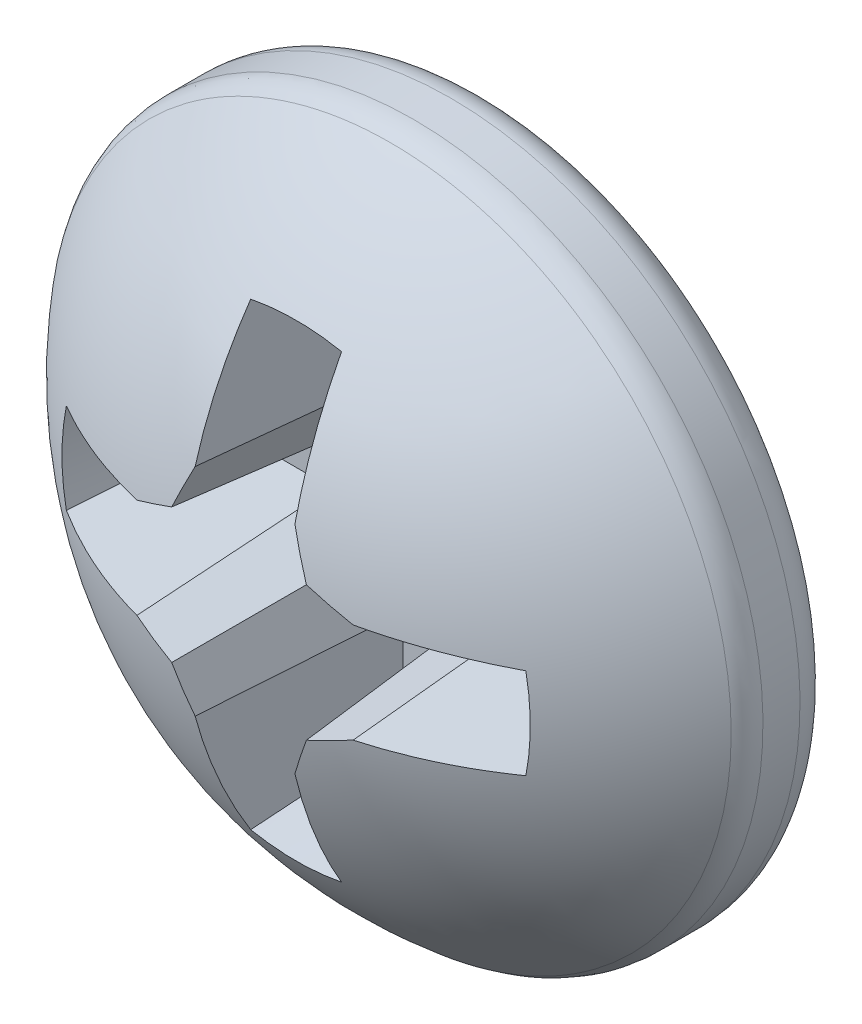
ISO-10303-21;
HEADER;
FILE_DESCRIPTION(('STEP AP214'),'2;1');
FILE_NAME('part.step','',(''),(''),'','','');
FILE_SCHEMA(('AUTOMOTIVE_DESIGN { 1 0 10303 214 1 1 1 1 }'));
ENDSEC;
DATA;
#1=APPLICATION_CONTEXT('core data for automotive mechanical design processes');
#2=APPLICATION_PROTOCOL_DEFINITION('international standard','automotive_design',2000,#1);
#3=PRODUCT_CONTEXT('',#1,'mechanical');
#4=PRODUCT('Part','Part','',(#3));
#5=PRODUCT_RELATED_PRODUCT_CATEGORY('part','',(#4));
#6=PRODUCT_DEFINITION_FORMATION('','',#4);
#7=PRODUCT_DEFINITION_CONTEXT('part definition',#1,'design');
#8=PRODUCT_DEFINITION('design','',#6,#7);
#9=PRODUCT_DEFINITION_SHAPE('','',#8);
#10=(LENGTH_UNIT() NAMED_UNIT(*) SI_UNIT(.MILLI.,.METRE.));
#11=(NAMED_UNIT(*) PLANE_ANGLE_UNIT() SI_UNIT($,.RADIAN.));
#12=(NAMED_UNIT(*) SI_UNIT($,.STERADIAN.) SOLID_ANGLE_UNIT());
#13=UNCERTAINTY_MEASURE_WITH_UNIT(LENGTH_MEASURE(1.E-05),#10,'distance_accuracy_value','');
#14=(GEOMETRIC_REPRESENTATION_CONTEXT(3) GLOBAL_UNCERTAINTY_ASSIGNED_CONTEXT((#13)) GLOBAL_UNIT_ASSIGNED_CONTEXT((#10,
#11,#12)) REPRESENTATION_CONTEXT('',''));
#15=CARTESIAN_POINT('',(0.,0.,0.));
#16=DIRECTION('',(0.,0.,1.));
#17=DIRECTION('',(1.,0.,0.));
#18=AXIS2_PLACEMENT_3D('',#15,#16,#17);
#19=CARTESIAN_POINT('',(0.,0.,2.69621));
#20=DIRECTION('',(0.,0.,-1.));
#21=DIRECTION('',(-1.,0.,0.));
#22=AXIS2_PLACEMENT_3D('',#19,#20,#21);
#23=PLANE('',#22);
#24=DIRECTION('',(0.,1.,0.));
#25=VECTOR('',#24,1.);
#26=CARTESIAN_POINT('',(-0.201485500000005,1.25648782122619,2.69621));
#27=LINE('',#26,#25);
#28=CARTESIAN_POINT('',(-0.201485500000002,0.63627,2.69621));
#29=VERTEX_POINT('',#28);
#30=CARTESIAN_POINT('',(-0.201485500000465,1.25648782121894,2.69621000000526));
#31=VERTEX_POINT('',#30);
#32=EDGE_CURVE('E294',#29,#31,#27,.T.);
#33=ORIENTED_EDGE('',*,*,#32,.F.);
#34=DIRECTION('',(0.382683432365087,0.923879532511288,0.));
#35=VECTOR('',#34,1.);
#36=CARTESIAN_POINT('',(-0.201485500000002,0.63627,2.69621));
#37=LINE('',#36,#35);
#38=CARTESIAN_POINT('',(-0.328830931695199,0.328830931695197,2.69621));
#39=VERTEX_POINT('',#38);
#40=EDGE_CURVE('E295',#39,#29,#37,.T.);
#41=ORIENTED_EDGE('',*,*,#40,.F.);
#42=DIRECTION('',(0.923879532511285,0.382683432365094,0.));
#43=VECTOR('',#42,1.);
#44=CARTESIAN_POINT('',(-0.328830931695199,0.328830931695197,2.69621));
#45=LINE('',#44,#43);
#46=CARTESIAN_POINT('',(-0.636270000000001,0.201485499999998,2.69621));
#47=VERTEX_POINT('',#46);
#48=EDGE_CURVE('E302',#47,#39,#45,.T.);
#49=ORIENTED_EDGE('',*,*,#48,.F.);
#50=DIRECTION('',(1.,0.,0.));
#51=VECTOR('',#50,1.);
#52=CARTESIAN_POINT('',(-1.2564878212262,0.201485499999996,2.69621));
#53=LINE('',#52,#51);
#54=CARTESIAN_POINT('',(-1.25648782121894,0.201485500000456,2.69621000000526));
#55=VERTEX_POINT('',#54);
#56=EDGE_CURVE('E309',#55,#47,#53,.T.);
#57=ORIENTED_EDGE('',*,*,#56,.F.);
#58=CARTESIAN_POINT('',(0.,0.,2.69621000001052));
#59=DIRECTION('',(0.,0.,1.));
#60=DIRECTION('',(1.,0.,0.));
#61=AXIS2_PLACEMENT_3D('',#58,#59,#60);
#62=CIRCLE('',#61,1.27253999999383);
#63=CARTESIAN_POINT('',(-1.25648782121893,-0.201485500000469,2.69621000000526));
#64=VERTEX_POINT('',#63);
#65=EDGE_CURVE('E397',#55,#64,#62,.T.);
#66=ORIENTED_EDGE('',*,*,#65,.T.);
#67=DIRECTION('',(1.,0.,0.));
#68=VECTOR('',#67,1.);
#69=CARTESIAN_POINT('',(-1.25648782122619,-0.201485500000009,2.69621));
#70=LINE('',#69,#68);
#71=CARTESIAN_POINT('',(-0.636269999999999,-0.201485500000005,2.69621));
#72=VERTEX_POINT('',#71);
#73=EDGE_CURVE('E316',#72,#64,#70,.F.);
#74=ORIENTED_EDGE('',*,*,#73,.F.);
#75=DIRECTION('',(-0.923879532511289,0.382683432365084,0.));
#76=VECTOR('',#75,1.);
#77=CARTESIAN_POINT('',(-0.636269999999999,-0.201485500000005,2.69621));
#78=LINE('',#77,#76);
#79=CARTESIAN_POINT('',(-0.328830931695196,-0.3288309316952,2.69621));
#80=VERTEX_POINT('',#79);
#81=EDGE_CURVE('E317',#80,#72,#78,.T.);
#82=ORIENTED_EDGE('',*,*,#81,.F.);
#83=DIRECTION('',(-0.382683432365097,0.923879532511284,0.));
#84=VECTOR('',#83,1.);
#85=CARTESIAN_POINT('',(-0.328830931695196,-0.3288309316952,2.69621));
#86=LINE('',#85,#84);
#87=CARTESIAN_POINT('',(-0.201485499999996,-0.636270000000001,2.69621));
#88=VERTEX_POINT('',#87);
#89=EDGE_CURVE('E324',#88,#80,#86,.T.);
#90=ORIENTED_EDGE('',*,*,#89,.F.);
#91=DIRECTION('',(0.,1.,0.));
#92=VECTOR('',#91,1.);
#93=CARTESIAN_POINT('',(-0.201485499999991,-1.2564878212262,2.69621));
#94=LINE('',#93,#92);
#95=CARTESIAN_POINT('',(-0.201485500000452,-1.25648782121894,2.69621000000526));
#96=VERTEX_POINT('',#95);
#97=EDGE_CURVE('E331',#96,#88,#94,.T.);
#98=ORIENTED_EDGE('',*,*,#97,.F.);
#99=CARTESIAN_POINT('',(0.,0.,2.69621000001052));
#100=DIRECTION('',(0.,0.,1.));
#101=DIRECTION('',(1.,0.,0.));
#102=AXIS2_PLACEMENT_3D('',#99,#100,#101);
#103=CIRCLE('',#102,1.27253999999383);
#104=CARTESIAN_POINT('',(0.201485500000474,-1.25648782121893,2.69621000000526));
#105=VERTEX_POINT('',#104);
#106=EDGE_CURVE('E213',#96,#105,#103,.T.);
#107=ORIENTED_EDGE('',*,*,#106,.T.);
#108=DIRECTION('',(0.,1.,0.));
#109=VECTOR('',#108,1.);
#110=CARTESIAN_POINT('',(0.201485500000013,-1.25648782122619,2.69621));
#111=LINE('',#110,#109);
#112=CARTESIAN_POINT('',(0.201485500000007,-0.636269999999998,2.69621));
#113=VERTEX_POINT('',#112);
#114=EDGE_CURVE('E217',#113,#105,#111,.F.);
#115=ORIENTED_EDGE('',*,*,#114,.F.);
#116=DIRECTION('',(-0.382683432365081,-0.923879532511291,0.));
#117=VECTOR('',#116,1.);
#118=CARTESIAN_POINT('',(0.201485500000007,-0.636269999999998,2.69621));
#119=LINE('',#118,#117);
#120=CARTESIAN_POINT('',(0.328830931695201,-0.328830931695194,2.69621));
#121=VERTEX_POINT('',#120);
#122=EDGE_CURVE('E338',#121,#113,#119,.T.);
#123=ORIENTED_EDGE('',*,*,#122,.F.);
#124=DIRECTION('',(-0.923879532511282,-0.382683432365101,0.));
#125=VECTOR('',#124,1.);
#126=CARTESIAN_POINT('',(0.328830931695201,-0.328830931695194,2.69621));
#127=LINE('',#126,#125);
#128=CARTESIAN_POINT('',(0.636270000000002,-0.201485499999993,2.69621));
#129=VERTEX_POINT('',#128);
#130=EDGE_CURVE('E345',#129,#121,#127,.T.);
#131=ORIENTED_EDGE('',*,*,#130,.F.);
#132=DIRECTION('',(1.,0.,0.));
#133=VECTOR('',#132,1.);
#134=CARTESIAN_POINT('',(1.2564878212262,-0.201485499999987,2.69621));
#135=LINE('',#134,#133);
#136=CARTESIAN_POINT('',(1.25648782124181,-0.201485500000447,2.69621000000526));
#137=VERTEX_POINT('',#136);
#138=EDGE_CURVE('E166',#137,#129,#135,.F.);
#139=ORIENTED_EDGE('',*,*,#138,.F.);
#140=CARTESIAN_POINT('',(0.,0.,2.69621000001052));
#141=DIRECTION('',(0.,0.,1.));
#142=DIRECTION('',(1.,0.,0.));
#143=AXIS2_PLACEMENT_3D('',#140,#141,#142);
#144=CIRCLE('',#143,1.27254000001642);
#145=CARTESIAN_POINT('',(1.25648782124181,0.201485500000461,2.69621000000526));
#146=VERTEX_POINT('',#145);
#147=EDGE_CURVE('E159',#137,#146,#144,.T.);
#148=ORIENTED_EDGE('',*,*,#147,.T.);
#149=DIRECTION('',(1.,0.,0.));
#150=VECTOR('',#149,1.);
#151=CARTESIAN_POINT('',(1.25648782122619,0.2014855,2.69621));
#152=LINE('',#151,#150);
#153=CARTESIAN_POINT('',(0.63627,0.2014855,2.69621));
#154=VERTEX_POINT('',#153);
#155=EDGE_CURVE('E163',#154,#146,#152,.T.);
#156=ORIENTED_EDGE('',*,*,#155,.F.);
#157=DIRECTION('',(0.923879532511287,-0.38268343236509,0.));
#158=VECTOR('',#157,1.);
#159=CARTESIAN_POINT('',(0.63627,0.2014855,2.69621));
#160=LINE('',#159,#158);
#161=CARTESIAN_POINT('',(0.328830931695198,0.328830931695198,2.69621));
#162=VERTEX_POINT('',#161);
#163=EDGE_CURVE('E355',#162,#154,#160,.T.);
#164=ORIENTED_EDGE('',*,*,#163,.F.);
#165=DIRECTION('',(0.382683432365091,-0.923879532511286,0.));
#166=VECTOR('',#165,1.);
#167=CARTESIAN_POINT('',(0.328830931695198,0.328830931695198,2.69621));
#168=LINE('',#167,#166);
#169=CARTESIAN_POINT('',(0.2014855,0.63627,2.69621));
#170=VERTEX_POINT('',#169);
#171=EDGE_CURVE('E362',#170,#162,#168,.T.);
#172=ORIENTED_EDGE('',*,*,#171,.F.);
#173=DIRECTION('',(0.,1.,0.));
#174=VECTOR('',#173,1.);
#175=CARTESIAN_POINT('',(0.2014855,1.25648782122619,2.69621));
#176=LINE('',#175,#174);
#177=CARTESIAN_POINT('',(0.2014855,1.25648782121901,2.69621000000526));
#178=VERTEX_POINT('',#177);
#179=EDGE_CURVE('E369',#178,#170,#176,.F.);
#180=ORIENTED_EDGE('',*,*,#179,.F.);
#181=CARTESIAN_POINT('',(0.,0.,2.69621000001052));
#182=DIRECTION('',(0.,0.,1.));
#183=DIRECTION('',(1.,0.,0.));
#184=AXIS2_PLACEMENT_3D('',#181,#182,#183);
#185=CIRCLE('',#184,1.27253999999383);
#186=EDGE_CURVE('E479',#178,#31,#185,.T.);
#187=ORIENTED_EDGE('',*,*,#186,.T.);
#188=EDGE_LOOP('',(#33,#41,#49,#57,#66,#74,#82,#90,#98,#107,#115,#123,#131,#139,#148,#156,#164,
#172,#180,#187));
#189=FACE_BOUND('',#188,.T.);
#190=ADVANCED_FACE('F19',(#189),#23,.F.);
#191=CARTESIAN_POINT('',(0.2014855,1.25648782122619,2.69621));
#192=DIRECTION('',(-0.996194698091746,0.,0.0871557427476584));
#193=DIRECTION('',(0.0871557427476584,0.,0.996194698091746));
#194=AXIS2_PLACEMENT_3D('',#191,#192,#193);
#195=PLANE('',#194);
#196=ORIENTED_EDGE('',*,*,#179,.T.);
#197=DIRECTION('',(-0.0871426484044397,-0.0173337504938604,-0.996045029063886));
#198=VECTOR('',#197,1.);
#199=CARTESIAN_POINT('',(0.302987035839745,0.656459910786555,3.85637786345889));
#200=LINE('',#199,#198);
#201=CARTESIAN_POINT('',(0.302987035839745,0.656459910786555,3.85637786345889));
#202=VERTEX_POINT('',#201);
#203=EDGE_CURVE('E365',#202,#170,#200,.T.);
#204=ORIENTED_EDGE('',*,*,#203,.F.);
#205=CARTESIAN_POINT('',(0.275834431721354,1.39538307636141,3.5460221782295));
#206=CARTESIAN_POINT('',(0.277369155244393,1.36664235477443,3.56356414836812));
#207=CARTESIAN_POINT('',(0.278856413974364,1.33756801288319,3.58056359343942));
#208=CARTESIAN_POINT('',(0.281727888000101,1.27891888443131,3.61338469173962));
#209=CARTESIAN_POINT('',(0.283112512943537,1.24934673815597,3.6292110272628));
#210=CARTESIAN_POINT('',(0.285779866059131,1.18970894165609,3.65969901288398));
#211=CARTESIAN_POINT('',(0.287062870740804,1.1596449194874,3.67436382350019));
#212=CARTESIAN_POINT('',(0.28952774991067,1.09902794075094,3.70253752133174));
#213=CARTESIAN_POINT('',(0.290709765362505,1.06847573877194,3.71604801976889));
#214=CARTESIAN_POINT('',(0.292973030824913,1.0068838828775,3.74191726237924));
#215=CARTESIAN_POINT('',(0.294054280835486,0.975844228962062,3.75427600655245));
#216=CARTESIAN_POINT('',(0.296115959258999,0.913276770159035,3.77784109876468));
#217=CARTESIAN_POINT('',(0.297096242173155,0.881748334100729,3.78904578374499));
#218=CARTESIAN_POINT('',(0.298955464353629,0.81820121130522,3.81029679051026));
#219=CARTESIAN_POINT('',(0.299834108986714,0.78618138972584,3.82033974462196));
#220=CARTESIAN_POINT('',(0.301489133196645,0.721647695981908,3.83925675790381));
#221=CARTESIAN_POINT('',(0.30226506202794,0.689132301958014,3.84812566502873));
#222=CARTESIAN_POINT('',(0.302987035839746,0.656459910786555,3.85637786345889));
#223=B_SPLINE_CURVE_WITH_KNOTS('',3,(#205,#206,#207,#208,#209,#210,#211,#212,#213,#214,#215,
#216,#217,#218,#219,#220,#221,#222),.UNSPECIFIED.,.F.,.F.,(4,2,2,2,2,2,2,2,4),(0.,
0.101112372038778,0.201796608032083,0.302196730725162,0.402454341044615,0.502711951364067,
0.603112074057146,0.703796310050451,0.804908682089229),.UNSPECIFIED.);
#224=CARTESIAN_POINT('',(0.275834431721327,1.39538307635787,3.5460221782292));
#225=VERTEX_POINT('',#224);
#226=EDGE_CURVE('E478',#225,#202,#223,.T.);
#227=ORIENTED_EDGE('',*,*,#226,.F.);
#228=CARTESIAN_POINT('',(0.275834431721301,1.39538307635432,3.5460221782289));
#229=CARTESIAN_POINT('',(0.263440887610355,1.37237872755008,3.40436332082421));
#230=CARTESIAN_POINT('',(0.251048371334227,1.34930194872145,3.26271621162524));
#231=CARTESIAN_POINT('',(0.22626539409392,1.30300353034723,2.97944548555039));
#232=CARTESIAN_POINT('',(0.2138749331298,1.27978189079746,2.83782186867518));
#233=CARTESIAN_POINT('',(0.201485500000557,1.25648782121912,2.69621000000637));
#234=B_SPLINE_CURVE_WITH_KNOTS('',3,(#228,#229,#230,#231,#232,#233),.UNSPECIFIED.,.F.,.F.,(4,2,
4),(0.,0.432145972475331,0.864291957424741),.UNSPECIFIED.);
#235=EDGE_CURVE('E375',#225,#178,#234,.T.);
#236=ORIENTED_EDGE('',*,*,#235,.T.);
#237=EDGE_LOOP('',(#196,#204,#227,#236));
#238=FACE_BOUND('',#237,.T.);
#239=ADVANCED_FACE('F501',(#238),#195,.T.);
#240=CARTESIAN_POINT('',(0.328830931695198,0.328830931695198,2.69621));
#241=DIRECTION('',(-0.920363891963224,-0.381227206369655,0.0871557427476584));
#242=DIRECTION('',(0.382683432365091,-0.923879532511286,0.));
#243=AXIS2_PLACEMENT_3D('',#240,#241,#242);
#244=PLANE('',#243);
#245=ORIENTED_EDGE('',*,*,#171,.T.);
#246=DIRECTION('',(-0.0666626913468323,-0.0666626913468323,-0.995546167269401));
#247=VECTOR('',#246,1.);
#248=CARTESIAN_POINT('',(0.408949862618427,0.408949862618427,3.89271276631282));
#249=LINE('',#248,#247);
#250=CARTESIAN_POINT('',(0.408949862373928,0.408949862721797,3.89271276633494));
#251=VERTEX_POINT('',#250);
#252=EDGE_CURVE('E358',#251,#162,#249,.T.);
#253=ORIENTED_EDGE('',*,*,#252,.F.);
#254=CARTESIAN_POINT('',(0.302987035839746,0.656459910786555,3.85637786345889));
#255=CARTESIAN_POINT('',(0.320713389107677,0.61557243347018,3.86472242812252));
#256=CARTESIAN_POINT('',(0.33840680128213,0.574502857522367,3.87192261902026));
#257=CARTESIAN_POINT('',(0.373727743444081,0.491999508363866,3.88403425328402));
#258=CARTESIAN_POINT('',(0.391355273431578,0.450565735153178,3.88894569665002));
#259=CARTESIAN_POINT('',(0.408949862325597,0.408949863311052,3.89271276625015));
#260=B_SPLINE_CURVE_WITH_KNOTS('',3,(#254,#255,#256,#257,#258,#259),.UNSPECIFIED.,.F.,.F.,(4,2,
4),(0.,0.135884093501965,0.27176818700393),.UNSPECIFIED.);
#261=EDGE_CURVE('E513',#202,#251,#260,.T.);
#262=ORIENTED_EDGE('',*,*,#261,.F.);
#263=ORIENTED_EDGE('',*,*,#203,.T.);
#264=EDGE_LOOP('',(#245,#253,#262,#263));
#265=FACE_BOUND('',#264,.T.);
#266=ADVANCED_FACE('F505',(#265),#244,.T.);
#267=CARTESIAN_POINT('',(0.63627,0.2014855,2.69621));
#268=DIRECTION('',(-0.381227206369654,-0.920363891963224,0.0871557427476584));
#269=DIRECTION('',(0.923879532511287,-0.38268343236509,0.));
#270=AXIS2_PLACEMENT_3D('',#267,#268,#269);
#271=PLANE('',#270);
#272=ORIENTED_EDGE('',*,*,#163,.T.);
#273=DIRECTION('',(-0.0173337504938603,-0.0871426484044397,-0.996045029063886));
#274=VECTOR('',#273,1.);
#275=CARTESIAN_POINT('',(0.656459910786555,0.302987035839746,3.85637786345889));
#276=LINE('',#275,#274);
#277=CARTESIAN_POINT('',(0.656459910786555,0.302987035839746,3.85637786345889));
#278=VERTEX_POINT('',#277);
#279=EDGE_CURVE('E179',#278,#154,#276,.T.);
#280=ORIENTED_EDGE('',*,*,#279,.F.);
#281=CARTESIAN_POINT('',(0.40894986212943,0.408949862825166,3.89271276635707));
#282=CARTESIAN_POINT('',(0.45056573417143,0.391355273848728,3.88894569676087));
#283=CARTESIAN_POINT('',(0.491999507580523,0.373727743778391,3.88403425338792));
#284=CARTESIAN_POINT('',(0.574502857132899,0.338406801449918,3.87192261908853));
#285=CARTESIAN_POINT('',(0.61557243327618,0.320713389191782,3.86472242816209));
#286=CARTESIAN_POINT('',(0.656459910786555,0.302987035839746,3.85637786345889));
#287=B_SPLINE_CURVE_WITH_KNOTS('',3,(#281,#282,#283,#284,#285,#286),.UNSPECIFIED.,.F.,.F.,(4,2,
4),(0.,0.135884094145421,0.271768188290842),.UNSPECIFIED.);
#288=EDGE_CURVE('E521',#251,#278,#287,.T.);
#289=ORIENTED_EDGE('',*,*,#288,.F.);
#290=ORIENTED_EDGE('',*,*,#252,.T.);
#291=EDGE_LOOP('',(#272,#280,#289,#290));
#292=FACE_BOUND('',#291,.T.);
#293=ADVANCED_FACE('F510',(#292),#271,.T.);
#294=CARTESIAN_POINT('',(1.25648782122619,0.2014855,2.69621));
#295=DIRECTION('',(0.,-0.996194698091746,0.0871557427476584));
#296=DIRECTION('',(0.,-0.0871557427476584,-0.996194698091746));
#297=AXIS2_PLACEMENT_3D('',#294,#295,#296);
#298=PLANE('',#297);
#299=ORIENTED_EDGE('',*,*,#155,.T.);
#300=CARTESIAN_POINT('',(1.25648782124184,0.201485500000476,2.69621000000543));
#301=CARTESIAN_POINT('',(1.27978189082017,0.213874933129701,2.83782186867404));
#302=CARTESIAN_POINT('',(1.30300353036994,0.226265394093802,2.97944548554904));
#303=CARTESIAN_POINT('',(1.34930194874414,0.251048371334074,3.26271621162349));
#304=CARTESIAN_POINT('',(1.37237872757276,0.263440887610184,3.40436332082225));
#305=CARTESIAN_POINT('',(1.39538307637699,0.275834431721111,3.54602217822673));
#306=B_SPLINE_CURVE_WITH_KNOTS('',3,(#300,#301,#302,#303,#304,#305),.UNSPECIFIED.,.F.,.F.,(4,2,
4),(0.,0.432145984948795,0.864291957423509),.UNSPECIFIED.);
#307=CARTESIAN_POINT('',(1.39538307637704,0.275834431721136,3.54602217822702));
#308=VERTEX_POINT('',#307);
#309=EDGE_CURVE('E172',#146,#308,#306,.T.);
#310=ORIENTED_EDGE('',*,*,#309,.T.);
#311=CARTESIAN_POINT('',(0.656459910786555,0.302987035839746,3.85637786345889));
#312=CARTESIAN_POINT('',(0.689132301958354,0.302265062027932,3.84812566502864));
#313=CARTESIAN_POINT('',(0.721647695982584,0.301489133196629,3.83925675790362));
#314=CARTESIAN_POINT('',(0.786181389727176,0.299834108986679,3.82033974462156));
#315=CARTESIAN_POINT('',(0.818201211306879,0.298955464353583,3.81029679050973));
#316=CARTESIAN_POINT('',(0.881748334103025,0.297096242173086,3.7890457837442));
#317=CARTESIAN_POINT('',(0.913276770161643,0.296115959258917,3.77784109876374));
#318=CARTESIAN_POINT('',(0.975844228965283,0.294054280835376,3.7542760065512));
#319=CARTESIAN_POINT('',(1.00688388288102,0.292973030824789,3.74191726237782));
#320=CARTESIAN_POINT('',(1.06847573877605,0.290709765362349,3.7160480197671));
#321=CARTESIAN_POINT('',(1.09902794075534,0.289527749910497,3.70253752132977));
#322=CARTESIAN_POINT('',(1.15964491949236,0.287062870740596,3.67436382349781));
#323=CARTESIAN_POINT('',(1.18970894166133,0.285779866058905,3.65969901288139));
#324=CARTESIAN_POINT('',(1.24934673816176,0.283112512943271,3.62921102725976));
#325=CARTESIAN_POINT('',(1.27891888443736,0.281727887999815,3.61338469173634));
#326=CARTESIAN_POINT('',(1.33756801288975,0.278856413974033,3.58056359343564));
#327=CARTESIAN_POINT('',(1.36664235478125,0.27736915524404,3.56356414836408));
#328=CARTESIAN_POINT('',(1.39538307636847,0.275834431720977,3.54602217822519));
#329=B_SPLINE_CURVE_WITH_KNOTS('',3,(#311,#312,#313,#314,#315,#316,#317,#318,#319,#320,#321,
#322,#323,#324,#325,#326,#327,#328),.UNSPECIFIED.,.F.,.F.,(4,2,2,2,2,2,2,2,4),(0.,
0.101112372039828,0.20179660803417,0.302196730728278,0.402454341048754,0.50271195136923,
0.603112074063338,0.703796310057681,0.804908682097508),.UNSPECIFIED.);
#330=EDGE_CURVE('E529',#278,#308,#329,.T.);
#331=ORIENTED_EDGE('',*,*,#330,.F.);
#332=ORIENTED_EDGE('',*,*,#279,.T.);
#333=EDGE_LOOP('',(#299,#310,#331,#332));
#334=FACE_BOUND('',#333,.T.);
#335=ADVANCED_FACE('F176',(#334),#298,.T.);
#336=CARTESIAN_POINT('',(0.,0.,3.5460221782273));
#337=DIRECTION('',(0.,0.,1.));
#338=DIRECTION('',(1.,0.,0.));
#339=AXIS2_PLACEMENT_3D('',#336,#337,#338);
#340=CONICAL_SURFACE('',#339,1.42238481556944,0.174532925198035);
#341=ORIENTED_EDGE('',*,*,#147,.F.);
#342=CARTESIAN_POINT('',(1.39538307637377,-0.275834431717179,3.5460221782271));
#343=CARTESIAN_POINT('',(1.37237872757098,-0.263440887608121,3.40436332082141));
#344=CARTESIAN_POINT('',(1.34930194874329,-0.251048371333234,3.26271621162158));
#345=CARTESIAN_POINT('',(1.30300353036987,-0.226265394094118,2.97944548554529));
#346=CARTESIAN_POINT('',(1.27978189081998,-0.213874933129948,2.8378218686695));
#347=CARTESIAN_POINT('',(1.25648782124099,-0.201485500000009,2.69621000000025));
#348=B_SPLINE_CURVE_WITH_KNOTS('',3,(#342,#343,#344,#345,#346,#347),.UNSPECIFIED.,.F.,.F.,(4,2,
4),(0.,0.432145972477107,0.864291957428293),.UNSPECIFIED.);
#349=CARTESIAN_POINT('',(1.39538307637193,-0.275834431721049,3.54602217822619));
#350=VERTEX_POINT('',#349);
#351=EDGE_CURVE('E171',#350,#137,#348,.T.);
#352=ORIENTED_EDGE('',*,*,#351,.F.);
#353=CARTESIAN_POINT('',(0.,0.,3.5460221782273));
#354=DIRECTION('',(0.,0.,1.));
#355=DIRECTION('',(1.,0.,0.));
#356=AXIS2_PLACEMENT_3D('',#353,#354,#355);
#357=CIRCLE('',#356,1.42238481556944);
#358=EDGE_CURVE('E185',#308,#350,#357,.F.);
#359=ORIENTED_EDGE('',*,*,#358,.F.);
#360=ORIENTED_EDGE('',*,*,#309,.F.);
#361=EDGE_LOOP('',(#341,#352,#359,#360));
#362=FACE_BOUND('',#361,.T.);
#363=ADVANCED_FACE('F183',(#362),#340,.F.);
#364=CARTESIAN_POINT('',(1.2564878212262,-0.201485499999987,2.69621));
#365=DIRECTION('',(0.,0.996194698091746,0.0871557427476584));
#366=DIRECTION('',(0.,-0.0871557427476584,0.996194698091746));
#367=AXIS2_PLACEMENT_3D('',#364,#365,#366);
#368=PLANE('',#367);
#369=ORIENTED_EDGE('',*,*,#138,.T.);
#370=DIRECTION('',(-0.0173337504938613,0.0871426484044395,-0.996045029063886));
#371=VECTOR('',#370,1.);
#372=CARTESIAN_POINT('',(0.656459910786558,-0.302987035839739,3.85637786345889));
#373=LINE('',#372,#371);
#374=CARTESIAN_POINT('',(0.656459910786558,-0.302987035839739,3.85637786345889));
#375=VERTEX_POINT('',#374);
#376=EDGE_CURVE('E348',#375,#129,#373,.T.);
#377=ORIENTED_EDGE('',*,*,#376,.F.);
#378=CARTESIAN_POINT('',(1.39538307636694,-0.275834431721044,3.54602217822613));
#379=CARTESIAN_POINT('',(1.36664235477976,-0.277369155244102,3.56356414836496));
#380=CARTESIAN_POINT('',(1.33756801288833,-0.278856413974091,3.58056359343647));
#381=CARTESIAN_POINT('',(1.27891888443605,-0.281727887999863,3.61338469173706));
#382=CARTESIAN_POINT('',(1.2493467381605,-0.283112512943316,3.62921102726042));
#383=CARTESIAN_POINT('',(1.1897089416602,-0.285779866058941,3.65969901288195));
#384=CARTESIAN_POINT('',(1.15964491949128,-0.287062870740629,3.67436382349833));
#385=CARTESIAN_POINT('',(1.09902794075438,-0.289527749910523,3.70253752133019));
#386=CARTESIAN_POINT('',(1.06847573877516,-0.290709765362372,3.71604801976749));
#387=CARTESIAN_POINT('',(1.00688388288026,-0.292973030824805,3.74191726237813));
#388=CARTESIAN_POINT('',(0.975844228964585,-0.29405428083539,3.75427600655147));
#389=CARTESIAN_POINT('',(0.913276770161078,-0.296115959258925,3.77784109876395));
#390=CARTESIAN_POINT('',(0.881748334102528,-0.297096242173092,3.78904578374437));
#391=CARTESIAN_POINT('',(0.818201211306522,-0.298955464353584,3.81029679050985));
#392=CARTESIAN_POINT('',(0.786181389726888,-0.299834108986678,3.82033974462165));
#393=CARTESIAN_POINT('',(0.72164769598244,-0.301489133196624,3.83925675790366));
#394=CARTESIAN_POINT('',(0.689132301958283,-0.302265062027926,3.84812566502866));
#395=CARTESIAN_POINT('',(0.656459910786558,-0.302987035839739,3.85637786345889));
#396=B_SPLINE_CURVE_WITH_KNOTS('',3,(#378,#379,#380,#381,#382,#383,#384,#385,#386,#387,#388,
#389,#390,#391,#392,#393,#394,#395),.UNSPECIFIED.,.F.,.F.,(4,2,2,2,2,2,2,2,4),(0.,
0.101112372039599,0.201796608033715,0.302196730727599,0.402454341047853,0.502711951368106,
0.60311207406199,0.703796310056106,0.804908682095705),.UNSPECIFIED.);
#397=EDGE_CURVE('E538',#350,#375,#396,.T.);
#398=ORIENTED_EDGE('',*,*,#397,.F.);
#399=ORIENTED_EDGE('',*,*,#351,.T.);
#400=EDGE_LOOP('',(#369,#377,#398,#399));
#401=FACE_BOUND('',#400,.T.);
#402=ADVANCED_FACE('F203',(#401),#368,.T.);
#403=CARTESIAN_POINT('',(0.328830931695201,-0.328830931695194,2.69621));
#404=DIRECTION('',(-0.381227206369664,0.92036389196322,0.0871557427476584));
#405=DIRECTION('',(-0.923879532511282,-0.382683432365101,0.));
#406=AXIS2_PLACEMENT_3D('',#403,#404,#405);
#407=PLANE('',#406);
#408=ORIENTED_EDGE('',*,*,#130,.T.);
#409=DIRECTION('',(-0.0666626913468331,0.0666626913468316,-0.995546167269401));
#410=VECTOR('',#409,1.);
#411=CARTESIAN_POINT('',(0.408949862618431,-0.408949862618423,3.89271276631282));
#412=LINE('',#411,#410);
#413=CARTESIAN_POINT('',(0.408949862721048,-0.408949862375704,3.89271276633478));
#414=VERTEX_POINT('',#413);
#415=EDGE_CURVE('E341',#414,#121,#412,.T.);
#416=ORIENTED_EDGE('',*,*,#415,.F.);
#417=CARTESIAN_POINT('',(0.656459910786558,-0.302987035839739,3.85637786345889));
#418=CARTESIAN_POINT('',(0.615572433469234,-0.320713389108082,3.86472242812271));
#419=CARTESIAN_POINT('',(0.574502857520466,-0.338406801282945,3.8719226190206));
#420=CARTESIAN_POINT('',(0.491999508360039,-0.373727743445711,3.88403425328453));
#421=CARTESIAN_POINT('',(0.450565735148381,-0.391355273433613,3.88894569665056));
#422=CARTESIAN_POINT('',(0.408949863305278,-0.408949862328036,3.89271276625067));
#423=B_SPLINE_CURVE_WITH_KNOTS('',3,(#417,#418,#419,#420,#421,#422),.UNSPECIFIED.,.F.,.F.,(4,2,
4),(0.,0.135884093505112,0.271768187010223),.UNSPECIFIED.);
#424=EDGE_CURVE('E546',#375,#414,#423,.T.);
#425=ORIENTED_EDGE('',*,*,#424,.F.);
#426=ORIENTED_EDGE('',*,*,#376,.T.);
#427=EDGE_LOOP('',(#408,#416,#425,#426));
#428=FACE_BOUND('',#427,.T.);
#429=ADVANCED_FACE('F559',(#428),#407,.T.);
#430=CARTESIAN_POINT('',(0.201485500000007,-0.636269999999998,2.69621));
#431=DIRECTION('',(-0.920363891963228,0.381227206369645,0.0871557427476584));
#432=DIRECTION('',(-0.382683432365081,-0.923879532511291,0.));
#433=AXIS2_PLACEMENT_3D('',#430,#431,#432);
#434=PLANE('',#433);
#435=ORIENTED_EDGE('',*,*,#122,.T.);
#436=DIRECTION('',(-0.0871426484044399,0.0173337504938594,-0.996045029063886));
#437=VECTOR('',#436,1.);
#438=CARTESIAN_POINT('',(0.302987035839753,-0.656459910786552,3.85637786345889));
#439=LINE('',#438,#437);
#440=CARTESIAN_POINT('',(0.302987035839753,-0.656459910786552,3.85637786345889));
#441=VERTEX_POINT('',#440);
#442=EDGE_CURVE('E334',#441,#113,#439,.T.);
#443=ORIENTED_EDGE('',*,*,#442,.F.);
#444=CARTESIAN_POINT('',(0.408949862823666,-0.408949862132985,3.89271276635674));
#445=CARTESIAN_POINT('',(0.391355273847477,-0.450565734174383,3.88894569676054));
#446=CARTESIAN_POINT('',(0.37372774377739,-0.49199950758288,3.88403425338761));
#447=CARTESIAN_POINT('',(0.338406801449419,-0.574502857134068,3.87192261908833));
#448=CARTESIAN_POINT('',(0.320713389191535,-0.615572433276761,3.86472242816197));
#449=CARTESIAN_POINT('',(0.302987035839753,-0.656459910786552,3.85637786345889));
#450=B_SPLINE_CURVE_WITH_KNOTS('',3,(#444,#445,#446,#447,#448,#449),.UNSPECIFIED.,.F.,.F.,(4,2,
4),(0.,0.135884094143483,0.271768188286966),.UNSPECIFIED.);
#451=EDGE_CURVE('E554',#414,#441,#450,.T.);
#452=ORIENTED_EDGE('',*,*,#451,.F.);
#453=ORIENTED_EDGE('',*,*,#415,.T.);
#454=EDGE_LOOP('',(#435,#443,#452,#453));
#455=FACE_BOUND('',#454,.T.);
#456=ADVANCED_FACE('F562',(#455),#434,.T.);
#457=CARTESIAN_POINT('',(0.201485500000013,-1.25648782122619,2.69621));
#458=DIRECTION('',(-0.996194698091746,0.,0.0871557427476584));
#459=DIRECTION('',(0.0871557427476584,0.,0.996194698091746));
#460=AXIS2_PLACEMENT_3D('',#457,#458,#459);
#461=PLANE('',#460);
#462=ORIENTED_EDGE('',*,*,#114,.T.);
#463=CARTESIAN_POINT('',(0.201485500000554,-1.25648782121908,2.69621000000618));
#464=CARTESIAN_POINT('',(0.2138749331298,-1.27978189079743,2.83782186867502));
#465=CARTESIAN_POINT('',(0.226265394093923,-1.30300353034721,2.97944548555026));
#466=CARTESIAN_POINT('',(0.251048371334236,-1.34930194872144,3.26271621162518));
#467=CARTESIAN_POINT('',(0.263440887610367,-1.37237872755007,3.40436332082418));
#468=CARTESIAN_POINT('',(0.275834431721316,-1.39538307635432,3.5460221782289));
#469=B_SPLINE_CURVE_WITH_KNOTS('',3,(#463,#464,#465,#466,#467,#468),.UNSPECIFIED.,.F.,.F.,(4,2,
4),(0.,0.432145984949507,0.864291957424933),.UNSPECIFIED.);
#470=CARTESIAN_POINT('',(0.275834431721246,-1.39538307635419,3.5460221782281));
#471=VERTEX_POINT('',#470);
#472=EDGE_CURVE('E216',#105,#471,#469,.T.);
#473=ORIENTED_EDGE('',*,*,#472,.T.);
#474=CARTESIAN_POINT('',(0.302987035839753,-0.656459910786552,3.85637786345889));
#475=CARTESIAN_POINT('',(0.302265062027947,-0.689132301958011,3.84812566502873));
#476=CARTESIAN_POINT('',(0.301489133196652,-0.721647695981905,3.83925675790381));
#477=CARTESIAN_POINT('',(0.299834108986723,-0.786181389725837,3.82033974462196));
#478=CARTESIAN_POINT('',(0.298955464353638,-0.818201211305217,3.81029679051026));
#479=CARTESIAN_POINT('',(0.297096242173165,-0.881748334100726,3.78904578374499));
#480=CARTESIAN_POINT('',(0.296115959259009,-0.913276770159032,3.77784109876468));
#481=CARTESIAN_POINT('',(0.294054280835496,-0.975844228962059,3.75427600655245));
#482=CARTESIAN_POINT('',(0.292973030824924,-1.0068838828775,3.74191726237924));
#483=CARTESIAN_POINT('',(0.290709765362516,-1.06847573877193,3.71604801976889));
#484=CARTESIAN_POINT('',(0.289527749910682,-1.09902794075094,3.70253752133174));
#485=CARTESIAN_POINT('',(0.287062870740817,-1.15964491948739,3.67436382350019));
#486=CARTESIAN_POINT('',(0.285779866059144,-1.18970894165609,3.65969901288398));
#487=CARTESIAN_POINT('',(0.28311251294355,-1.24934673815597,3.6292110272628));
#488=CARTESIAN_POINT('',(0.281727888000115,-1.27891888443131,3.61338469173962));
#489=CARTESIAN_POINT('',(0.278856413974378,-1.33756801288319,3.58056359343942));
#490=CARTESIAN_POINT('',(0.277369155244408,-1.36664235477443,3.56356414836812));
#491=CARTESIAN_POINT('',(0.275834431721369,-1.39538307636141,3.5460221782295));
#492=B_SPLINE_CURVE_WITH_KNOTS('',3,(#474,#475,#476,#477,#478,#479,#480,#481,#482,#483,#484,
#485,#486,#487,#488,#489,#490,#491),.UNSPECIFIED.,.F.,.F.,(4,2,2,2,2,2,2,2,4),(0.,
0.101112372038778,0.201796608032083,0.302196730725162,0.402454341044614,0.502711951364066,
0.603112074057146,0.703796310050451,0.804908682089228),.UNSPECIFIED.);
#493=EDGE_CURVE('E933',#441,#471,#492,.T.);
#494=ORIENTED_EDGE('',*,*,#493,.F.);
#495=ORIENTED_EDGE('',*,*,#442,.T.);
#496=EDGE_LOOP('',(#462,#473,#494,#495));
#497=FACE_BOUND('',#496,.T.);
#498=ADVANCED_FACE('F234',(#497),#461,.T.);
#499=CARTESIAN_POINT('',(0.,0.,3.54602217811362));
#500=DIRECTION('',(0.,0.,1.));
#501=DIRECTION('',(1.,0.,0.));
#502=AXIS2_PLACEMENT_3D('',#499,#500,#501);
#503=CONICAL_SURFACE('',#502,1.42238481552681,0.174532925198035);
#504=CARTESIAN_POINT('',(0.,0.,3.5460221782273));
#505=DIRECTION('',(0.,0.,1.));
#506=DIRECTION('',(1.,0.,0.));
#507=AXIS2_PLACEMENT_3D('',#504,#505,#506);
#508=CIRCLE('',#507,1.42238481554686);
#509=CARTESIAN_POINT('',(-0.275834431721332,-1.3953830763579,3.54602217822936));
#510=VERTEX_POINT('',#509);
#511=EDGE_CURVE('E263',#471,#510,#508,.F.);
#512=ORIENTED_EDGE('',*,*,#511,.F.);
#513=ORIENTED_EDGE('',*,*,#472,.F.);
#514=ORIENTED_EDGE('',*,*,#106,.F.);
#515=CARTESIAN_POINT('',(-0.27583443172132,-1.39538307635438,3.54602217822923));
#516=CARTESIAN_POINT('',(-0.263440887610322,-1.37237872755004,3.40436332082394));
#517=CARTESIAN_POINT('',(-0.251048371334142,-1.34930194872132,3.26271621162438));
#518=CARTESIAN_POINT('',(-0.226265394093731,-1.3030035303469,2.97944548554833));
#519=CARTESIAN_POINT('',(-0.213874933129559,-1.27978189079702,2.83782186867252));
#520=CARTESIAN_POINT('',(-0.201485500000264,-1.25648782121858,2.69621000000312));
#521=B_SPLINE_CURVE_WITH_KNOTS('',3,(#515,#516,#517,#518,#519,#520),.UNSPECIFIED.,.F.,.F.,(4,2,
4),(0.,0.432145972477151,0.864291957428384),.UNSPECIFIED.);
#522=EDGE_CURVE('E227',#510,#96,#521,.T.);
#523=ORIENTED_EDGE('',*,*,#522,.F.);
#524=EDGE_LOOP('',(#512,#513,#514,#523));
#525=FACE_BOUND('',#524,.T.);
#526=ADVANCED_FACE('F237',(#525),#503,.F.);
#527=CARTESIAN_POINT('',(-0.201485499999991,-1.2564878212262,2.69621));
#528=DIRECTION('',(0.996194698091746,0.,0.0871557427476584));
#529=DIRECTION('',(0.0871557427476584,0.,-0.996194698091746));
#530=AXIS2_PLACEMENT_3D('',#527,#528,#529);
#531=PLANE('',#530);
#532=ORIENTED_EDGE('',*,*,#97,.T.);
#533=DIRECTION('',(0.0871426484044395,0.0173337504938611,-0.996045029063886));
#534=VECTOR('',#533,1.);
#535=CARTESIAN_POINT('',(-0.302987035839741,-0.656459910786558,3.85637786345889));
#536=LINE('',#535,#534);
#537=CARTESIAN_POINT('',(-0.302987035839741,-0.656459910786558,3.85637786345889));
#538=VERTEX_POINT('',#537);
#539=EDGE_CURVE('E327',#538,#88,#536,.T.);
#540=ORIENTED_EDGE('',*,*,#539,.F.);
#541=CARTESIAN_POINT('',(-0.275834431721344,-1.39538307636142,3.5460221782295));
#542=CARTESIAN_POINT('',(-0.277369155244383,-1.36664235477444,3.56356414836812));
#543=CARTESIAN_POINT('',(-0.278856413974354,-1.3375680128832,3.58056359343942));
#544=CARTESIAN_POINT('',(-0.281727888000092,-1.27891888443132,3.61338469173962));
#545=CARTESIAN_POINT('',(-0.283112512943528,-1.24934673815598,3.6292110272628));
#546=CARTESIAN_POINT('',(-0.285779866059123,-1.1897089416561,3.65969901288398));
#547=CARTESIAN_POINT('',(-0.287062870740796,-1.1596449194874,3.67436382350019));
#548=CARTESIAN_POINT('',(-0.289527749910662,-1.09902794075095,3.70253752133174));
#549=CARTESIAN_POINT('',(-0.290709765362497,-1.06847573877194,3.71604801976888));
#550=CARTESIAN_POINT('',(-0.292973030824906,-1.0068838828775,3.74191726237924));
#551=CARTESIAN_POINT('',(-0.294054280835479,-0.975844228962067,3.75427600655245));
#552=CARTESIAN_POINT('',(-0.296115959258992,-0.913276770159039,3.77784109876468));
#553=CARTESIAN_POINT('',(-0.297096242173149,-0.881748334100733,3.78904578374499));
#554=CARTESIAN_POINT('',(-0.298955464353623,-0.818201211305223,3.81029679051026));
#555=CARTESIAN_POINT('',(-0.299834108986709,-0.786181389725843,3.82033974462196));
#556=CARTESIAN_POINT('',(-0.30148913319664,-0.721647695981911,3.83925675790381));
#557=CARTESIAN_POINT('',(-0.302265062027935,-0.689132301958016,3.84812566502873));
#558=CARTESIAN_POINT('',(-0.302987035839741,-0.656459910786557,3.85637786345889));
#559=B_SPLINE_CURVE_WITH_KNOTS('',3,(#541,#542,#543,#544,#545,#546,#547,#548,#549,#550,#551,
#552,#553,#554,#555,#556,#557,#558),.UNSPECIFIED.,.F.,.F.,(4,2,2,2,2,2,2,2,4),(0.,
0.101112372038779,0.201796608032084,0.302196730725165,0.402454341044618,0.502711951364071,
0.603112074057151,0.703796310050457,0.804908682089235),.UNSPECIFIED.);
#560=EDGE_CURVE('E252',#510,#538,#559,.T.);
#561=ORIENTED_EDGE('',*,*,#560,.F.);
#562=ORIENTED_EDGE('',*,*,#522,.T.);
#563=EDGE_LOOP('',(#532,#540,#561,#562));
#564=FACE_BOUND('',#563,.T.);
#565=ADVANCED_FACE('F240',(#564),#531,.T.);
#566=CARTESIAN_POINT('',(-0.328830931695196,-0.3288309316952,2.69621));
#567=DIRECTION('',(0.920363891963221,0.381227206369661,0.0871557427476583));
#568=DIRECTION('',(-0.382683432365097,0.923879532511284,0.));
#569=AXIS2_PLACEMENT_3D('',#566,#567,#568);
#570=PLANE('',#569);
#571=ORIENTED_EDGE('',*,*,#89,.T.);
#572=DIRECTION('',(0.0666626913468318,0.0666626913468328,-0.995546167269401));
#573=VECTOR('',#572,1.);
#574=CARTESIAN_POINT('',(-0.408949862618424,-0.40894986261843,3.89271276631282));
#575=LINE('',#574,#573);
#576=CARTESIAN_POINT('',(-0.408949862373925,-0.4089498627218,3.89271276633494));
#577=VERTEX_POINT('',#576);
#578=EDGE_CURVE('E320',#577,#80,#575,.T.);
#579=ORIENTED_EDGE('',*,*,#578,.F.);
#580=CARTESIAN_POINT('',(-0.302987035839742,-0.656459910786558,3.85637786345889));
#581=CARTESIAN_POINT('',(-0.320713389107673,-0.615572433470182,3.86472242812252));
#582=CARTESIAN_POINT('',(-0.338406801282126,-0.574502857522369,3.87192261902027));
#583=CARTESIAN_POINT('',(-0.373727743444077,-0.491999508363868,3.88403425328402));
#584=CARTESIAN_POINT('',(-0.391355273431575,-0.45056573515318,3.88894569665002));
#585=CARTESIAN_POINT('',(-0.408949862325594,-0.408949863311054,3.89271276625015));
#586=B_SPLINE_CURVE_WITH_KNOTS('',3,(#580,#581,#582,#583,#584,#585),.UNSPECIFIED.,.F.,.F.,(4,2,
4),(0.,0.135884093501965,0.27176818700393),.UNSPECIFIED.);
#587=EDGE_CURVE('E262',#538,#577,#586,.T.);
#588=ORIENTED_EDGE('',*,*,#587,.F.);
#589=ORIENTED_EDGE('',*,*,#539,.T.);
#590=EDGE_LOOP('',(#571,#579,#588,#589));
#591=FACE_BOUND('',#590,.T.);
#592=ADVANCED_FACE('F246',(#591),#570,.T.);
#593=CARTESIAN_POINT('',(-0.636269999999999,-0.201485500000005,2.69621));
#594=DIRECTION('',(0.381227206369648,0.920363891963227,0.0871557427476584));
#595=DIRECTION('',(-0.923879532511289,0.382683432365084,0.));
#596=AXIS2_PLACEMENT_3D('',#593,#594,#595);
#597=PLANE('',#596);
#598=ORIENTED_EDGE('',*,*,#81,.T.);
#599=DIRECTION('',(0.0173337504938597,0.0871426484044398,-0.996045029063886));
#600=VECTOR('',#599,1.);
#601=CARTESIAN_POINT('',(-0.656459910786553,-0.30298703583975,3.85637786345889));
#602=LINE('',#601,#600);
#603=CARTESIAN_POINT('',(-0.656459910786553,-0.30298703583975,3.85637786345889));
#604=VERTEX_POINT('',#603);
#605=EDGE_CURVE('E312',#604,#72,#602,.T.);
#606=ORIENTED_EDGE('',*,*,#605,.F.);
#607=CARTESIAN_POINT('',(-0.408949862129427,-0.408949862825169,3.89271276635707));
#608=CARTESIAN_POINT('',(-0.450565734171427,-0.391355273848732,3.88894569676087));
#609=CARTESIAN_POINT('',(-0.491999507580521,-0.373727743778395,3.88403425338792));
#610=CARTESIAN_POINT('',(-0.574502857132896,-0.338406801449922,3.87192261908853));
#611=CARTESIAN_POINT('',(-0.615572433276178,-0.320713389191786,3.86472242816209));
#612=CARTESIAN_POINT('',(-0.656459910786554,-0.30298703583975,3.85637786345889));
#613=B_SPLINE_CURVE_WITH_KNOTS('',3,(#607,#608,#609,#610,#611,#612),.UNSPECIFIED.,.F.,.F.,(4,2,
4),(0.,0.135884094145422,0.271768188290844),.UNSPECIFIED.);
#614=EDGE_CURVE('E906',#577,#604,#613,.T.);
#615=ORIENTED_EDGE('',*,*,#614,.F.);
#616=ORIENTED_EDGE('',*,*,#578,.T.);
#617=EDGE_LOOP('',(#598,#606,#615,#616));
#618=FACE_BOUND('',#617,.T.);
#619=ADVANCED_FACE('F721',(#618),#597,.T.);
#620=CARTESIAN_POINT('',(-1.25648782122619,-0.201485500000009,2.69621));
#621=DIRECTION('',(0.,0.996194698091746,0.0871557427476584));
#622=DIRECTION('',(0.,-0.0871557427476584,0.996194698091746));
#623=AXIS2_PLACEMENT_3D('',#620,#621,#622);
#624=PLANE('',#623);
#625=ORIENTED_EDGE('',*,*,#73,.T.);
#626=CARTESIAN_POINT('',(-1.25648782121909,-0.20148550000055,2.69621000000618));
#627=CARTESIAN_POINT('',(-1.27978189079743,-0.213874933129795,2.83782186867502));
#628=CARTESIAN_POINT('',(-1.30300353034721,-0.226265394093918,2.97944548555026));
#629=CARTESIAN_POINT('',(-1.34930194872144,-0.251048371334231,3.26271621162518));
#630=CARTESIAN_POINT('',(-1.37237872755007,-0.263440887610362,3.40436332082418));
#631=CARTESIAN_POINT('',(-1.39538307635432,-0.275834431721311,3.5460221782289));
#632=B_SPLINE_CURVE_WITH_KNOTS('',3,(#626,#627,#628,#629,#630,#631),.UNSPECIFIED.,.F.,.F.,(4,2,
4),(0.,0.432145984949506,0.864291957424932),.UNSPECIFIED.);
#633=CARTESIAN_POINT('',(-1.39538307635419,-0.275834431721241,3.5460221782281));
#634=VERTEX_POINT('',#633);
#635=EDGE_CURVE('E869',#64,#634,#632,.T.);
#636=ORIENTED_EDGE('',*,*,#635,.T.);
#637=CARTESIAN_POINT('',(-0.656459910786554,-0.302987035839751,3.85637786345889));
#638=CARTESIAN_POINT('',(-0.689132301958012,-0.302265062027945,3.84812566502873));
#639=CARTESIAN_POINT('',(-0.721647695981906,-0.30148913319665,3.83925675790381));
#640=CARTESIAN_POINT('',(-0.786181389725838,-0.29983410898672,3.82033974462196));
#641=CARTESIAN_POINT('',(-0.818201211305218,-0.298955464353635,3.81029679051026));
#642=CARTESIAN_POINT('',(-0.881748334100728,-0.297096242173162,3.78904578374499));
#643=CARTESIAN_POINT('',(-0.913276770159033,-0.296115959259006,3.77784109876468));
#644=CARTESIAN_POINT('',(-0.975844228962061,-0.294054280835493,3.75427600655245));
#645=CARTESIAN_POINT('',(-1.0068838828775,-0.29297303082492,3.74191726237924));
#646=CARTESIAN_POINT('',(-1.06847573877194,-0.290709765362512,3.71604801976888));
#647=CARTESIAN_POINT('',(-1.09902794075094,-0.289527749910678,3.70253752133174));
#648=CARTESIAN_POINT('',(-1.1596449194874,-0.287062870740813,3.67436382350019));
#649=CARTESIAN_POINT('',(-1.18970894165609,-0.28577986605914,3.65969901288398));
#650=CARTESIAN_POINT('',(-1.24934673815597,-0.283112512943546,3.6292110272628));
#651=CARTESIAN_POINT('',(-1.27891888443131,-0.28172788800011,3.61338469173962));
#652=CARTESIAN_POINT('',(-1.33756801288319,-0.278856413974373,3.58056359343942));
#653=CARTESIAN_POINT('',(-1.36664235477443,-0.277369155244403,3.56356414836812));
#654=CARTESIAN_POINT('',(-1.39538307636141,-0.275834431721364,3.5460221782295));
#655=B_SPLINE_CURVE_WITH_KNOTS('',3,(#637,#638,#639,#640,#641,#642,#643,#644,#645,#646,#647,
#648,#649,#650,#651,#652,#653,#654),.UNSPECIFIED.,.F.,.F.,(4,2,2,2,2,2,2,2,4),(0.,
0.101112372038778,0.201796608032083,0.302196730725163,0.402454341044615,0.502711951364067,
0.603112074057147,0.703796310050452,0.80490868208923),.UNSPECIFIED.);
#656=EDGE_CURVE('E900',#604,#634,#655,.T.);
#657=ORIENTED_EDGE('',*,*,#656,.F.);
#658=ORIENTED_EDGE('',*,*,#605,.T.);
#659=EDGE_LOOP('',(#625,#636,#657,#658));
#660=FACE_BOUND('',#659,.T.);
#661=ADVANCED_FACE('F712',(#660),#624,.T.);
#662=CARTESIAN_POINT('',(0.,0.,3.54602217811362));
#663=DIRECTION('',(0.,0.,1.));
#664=DIRECTION('',(1.,0.,0.));
#665=AXIS2_PLACEMENT_3D('',#662,#663,#664);
#666=CONICAL_SURFACE('',#665,1.42238481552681,0.174532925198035);
#667=ORIENTED_EDGE('',*,*,#635,.F.);
#668=ORIENTED_EDGE('',*,*,#65,.F.);
#669=CARTESIAN_POINT('',(-1.39538307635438,0.275834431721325,3.54602217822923));
#670=CARTESIAN_POINT('',(-1.37237872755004,0.263440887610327,3.40436332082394));
#671=CARTESIAN_POINT('',(-1.34930194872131,0.251048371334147,3.26271621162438));
#672=CARTESIAN_POINT('',(-1.3030035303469,0.226265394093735,2.97944548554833));
#673=CARTESIAN_POINT('',(-1.27978189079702,0.213874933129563,2.83782186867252));
#674=CARTESIAN_POINT('',(-1.25648782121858,0.201485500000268,2.69621000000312));
#675=B_SPLINE_CURVE_WITH_KNOTS('',3,(#669,#670,#671,#672,#673,#674),.UNSPECIFIED.,.F.,.F.,(4,2,
4),(0.,0.432145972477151,0.864291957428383),.UNSPECIFIED.);
#676=CARTESIAN_POINT('',(-1.3953830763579,0.275834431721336,3.54602217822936));
#677=VERTEX_POINT('',#676);
#678=EDGE_CURVE('E392',#677,#55,#675,.T.);
#679=ORIENTED_EDGE('',*,*,#678,.F.);
#680=CARTESIAN_POINT('',(0.,0.,3.5460221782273));
#681=DIRECTION('',(0.,0.,1.));
#682=DIRECTION('',(1.,0.,0.));
#683=AXIS2_PLACEMENT_3D('',#680,#681,#682);
#684=CIRCLE('',#683,1.42238481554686);
#685=EDGE_CURVE('E893',#634,#677,#684,.F.);
#686=ORIENTED_EDGE('',*,*,#685,.F.);
#687=EDGE_LOOP('',(#667,#668,#679,#686));
#688=FACE_BOUND('',#687,.T.);
#689=ADVANCED_FACE('F703',(#688),#666,.F.);
#690=CARTESIAN_POINT('',(-1.2564878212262,0.201485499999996,2.69621));
#691=DIRECTION('',(0.,-0.996194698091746,0.0871557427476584));
#692=DIRECTION('',(0.,-0.0871557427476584,-0.996194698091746));
#693=AXIS2_PLACEMENT_3D('',#690,#691,#692);
#694=PLANE('',#693);
#695=ORIENTED_EDGE('',*,*,#56,.T.);
#696=DIRECTION('',(0.0173337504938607,-0.0871426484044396,-0.996045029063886));
#697=VECTOR('',#696,1.);
#698=CARTESIAN_POINT('',(-0.656459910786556,0.302987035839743,3.85637786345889));
#699=LINE('',#698,#697);
#700=CARTESIAN_POINT('',(-0.656459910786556,0.302987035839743,3.85637786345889));
#701=VERTEX_POINT('',#700);
#702=EDGE_CURVE('E305',#701,#47,#699,.T.);
#703=ORIENTED_EDGE('',*,*,#702,.F.);
#704=CARTESIAN_POINT('',(-1.39538307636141,0.275834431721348,3.5460221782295));
#705=CARTESIAN_POINT('',(-1.36664235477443,0.277369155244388,3.56356414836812));
#706=CARTESIAN_POINT('',(-1.33756801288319,0.278856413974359,3.58056359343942));
#707=CARTESIAN_POINT('',(-1.27891888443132,0.281727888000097,3.61338469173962));
#708=CARTESIAN_POINT('',(-1.24934673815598,0.283112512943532,3.6292110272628));
#709=CARTESIAN_POINT('',(-1.1897089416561,0.285779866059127,3.65969901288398));
#710=CARTESIAN_POINT('',(-1.1596449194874,0.2870628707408,3.67436382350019));
#711=CARTESIAN_POINT('',(-1.09902794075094,0.289527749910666,3.70253752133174));
#712=CARTESIAN_POINT('',(-1.06847573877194,0.290709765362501,3.71604801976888));
#713=CARTESIAN_POINT('',(-1.0068838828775,0.292973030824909,3.74191726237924));
#714=CARTESIAN_POINT('',(-0.975844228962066,0.294054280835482,3.75427600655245));
#715=CARTESIAN_POINT('',(-0.913276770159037,0.296115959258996,3.77784109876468));
#716=CARTESIAN_POINT('',(-0.881748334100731,0.297096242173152,3.78904578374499));
#717=CARTESIAN_POINT('',(-0.818201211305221,0.298955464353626,3.81029679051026));
#718=CARTESIAN_POINT('',(-0.786181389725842,0.299834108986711,3.82033974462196));
#719=CARTESIAN_POINT('',(-0.72164769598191,0.301489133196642,3.83925675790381));
#720=CARTESIAN_POINT('',(-0.689132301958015,0.302265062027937,3.84812566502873));
#721=CARTESIAN_POINT('',(-0.656459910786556,0.302987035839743,3.85637786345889));
#722=B_SPLINE_CURVE_WITH_KNOTS('',3,(#704,#705,#706,#707,#708,#709,#710,#711,#712,#713,#714,
#715,#716,#717,#718,#719,#720,#721),.UNSPECIFIED.,.F.,.F.,(4,2,2,2,2,2,2,2,4),(0.,
0.101112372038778,0.201796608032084,0.302196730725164,0.402454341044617,0.502711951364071,
0.603112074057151,0.703796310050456,0.804908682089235),.UNSPECIFIED.);
#723=EDGE_CURVE('E865',#677,#701,#722,.T.);
#724=ORIENTED_EDGE('',*,*,#723,.F.);
#725=ORIENTED_EDGE('',*,*,#678,.T.);
#726=EDGE_LOOP('',(#695,#703,#724,#725));
#727=FACE_BOUND('',#726,.T.);
#728=ADVANCED_FACE('F694',(#727),#694,.T.);
#729=CARTESIAN_POINT('',(-0.328830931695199,0.328830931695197,2.69621));
#730=DIRECTION('',(0.381227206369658,-0.920363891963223,0.0871557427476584));
#731=DIRECTION('',(0.923879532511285,0.382683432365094,0.));
#732=AXIS2_PLACEMENT_3D('',#729,#730,#731);
#733=PLANE('',#732);
#734=ORIENTED_EDGE('',*,*,#48,.T.);
#735=DIRECTION('',(0.0666626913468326,-0.0666626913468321,-0.995546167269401));
#736=VECTOR('',#735,1.);
#737=CARTESIAN_POINT('',(-0.408949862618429,0.408949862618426,3.89271276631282));
#738=LINE('',#737,#736);
#739=CARTESIAN_POINT('',(-0.408949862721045,0.408949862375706,3.89271276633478));
#740=VERTEX_POINT('',#739);
#741=EDGE_CURVE('E298',#740,#39,#738,.T.);
#742=ORIENTED_EDGE('',*,*,#741,.F.);
#743=CARTESIAN_POINT('',(-0.656459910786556,0.302987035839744,3.85637786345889));
#744=CARTESIAN_POINT('',(-0.615572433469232,0.320713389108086,3.86472242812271));
#745=CARTESIAN_POINT('',(-0.574502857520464,0.338406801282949,3.8719226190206));
#746=CARTESIAN_POINT('',(-0.491999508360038,0.373727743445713,3.88403425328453));
#747=CARTESIAN_POINT('',(-0.45056573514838,0.391355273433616,3.88894569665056));
#748=CARTESIAN_POINT('',(-0.408949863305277,0.408949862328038,3.89271276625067));
#749=B_SPLINE_CURVE_WITH_KNOTS('',3,(#743,#744,#745,#746,#747,#748),.UNSPECIFIED.,.F.,.F.,(4,2,
4),(0.,0.13588409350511,0.271768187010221),.UNSPECIFIED.);
#750=EDGE_CURVE('E862',#701,#740,#749,.T.);
#751=ORIENTED_EDGE('',*,*,#750,.F.);
#752=ORIENTED_EDGE('',*,*,#702,.T.);
#753=EDGE_LOOP('',(#734,#742,#751,#752));
#754=FACE_BOUND('',#753,.T.);
#755=ADVANCED_FACE('F685',(#754),#733,.T.);
#756=CARTESIAN_POINT('',(-0.201485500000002,0.63627,2.69621));
#757=DIRECTION('',(0.920363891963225,-0.381227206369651,0.0871557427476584));
#758=DIRECTION('',(0.382683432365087,0.923879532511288,0.));
#759=AXIS2_PLACEMENT_3D('',#756,#757,#758);
#760=PLANE('',#759);
#761=ORIENTED_EDGE('',*,*,#40,.T.);
#762=DIRECTION('',(0.0871426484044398,-0.0173337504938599,-0.996045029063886));
#763=VECTOR('',#762,1.);
#764=CARTESIAN_POINT('',(-0.302987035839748,0.656459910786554,3.85637786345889));
#765=LINE('',#764,#763);
#766=CARTESIAN_POINT('',(-0.302987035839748,0.656459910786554,3.85637786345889));
#767=VERTEX_POINT('',#766);
#768=EDGE_CURVE('E290',#767,#29,#765,.T.);
#769=ORIENTED_EDGE('',*,*,#768,.F.);
#770=CARTESIAN_POINT('',(-0.408949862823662,0.408949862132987,3.89271276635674));
#771=CARTESIAN_POINT('',(-0.391355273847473,0.450565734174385,3.88894569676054));
#772=CARTESIAN_POINT('',(-0.373727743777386,0.491999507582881,3.88403425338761));
#773=CARTESIAN_POINT('',(-0.338406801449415,0.57450285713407,3.87192261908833));
#774=CARTESIAN_POINT('',(-0.320713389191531,0.615572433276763,3.86472242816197));
#775=CARTESIAN_POINT('',(-0.302987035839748,0.656459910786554,3.85637786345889));
#776=B_SPLINE_CURVE_WITH_KNOTS('',3,(#770,#771,#772,#773,#774,#775),.UNSPECIFIED.,.F.,.F.,(4,2,
4),(0.,0.135884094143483,0.271768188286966),.UNSPECIFIED.);
#777=EDGE_CURVE('E454',#740,#767,#776,.T.);
#778=ORIENTED_EDGE('',*,*,#777,.F.);
#779=ORIENTED_EDGE('',*,*,#741,.T.);
#780=EDGE_LOOP('',(#761,#769,#778,#779));
#781=FACE_BOUND('',#780,.T.);
#782=ADVANCED_FACE('F464',(#781),#760,.T.);
#783=CARTESIAN_POINT('',(-0.201485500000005,1.25648782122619,2.69621));
#784=DIRECTION('',(0.996194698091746,0.,0.0871557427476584));
#785=DIRECTION('',(0.0871557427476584,0.,-0.996194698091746));
#786=AXIS2_PLACEMENT_3D('',#783,#784,#785);
#787=PLANE('',#786);
#788=ORIENTED_EDGE('',*,*,#32,.T.);
#789=CARTESIAN_POINT('',(-0.201485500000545,1.25648782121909,2.69621000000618));
#790=CARTESIAN_POINT('',(-0.213874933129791,1.27978189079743,2.83782186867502));
#791=CARTESIAN_POINT('',(-0.226265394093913,1.30300353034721,2.97944548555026));
#792=CARTESIAN_POINT('',(-0.251048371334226,1.34930194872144,3.26271621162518));
#793=CARTESIAN_POINT('',(-0.263440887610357,1.37237872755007,3.40436332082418));
#794=CARTESIAN_POINT('',(-0.275834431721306,1.39538307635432,3.5460221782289));
#795=B_SPLINE_CURVE_WITH_KNOTS('',3,(#789,#790,#791,#792,#793,#794),.UNSPECIFIED.,.F.,.F.,(4,2,
4),(0.,0.432145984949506,0.864291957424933),.UNSPECIFIED.);
#796=CARTESIAN_POINT('',(-0.275834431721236,1.39538307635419,3.5460221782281));
#797=VERTEX_POINT('',#796);
#798=EDGE_CURVE('E470',#31,#797,#795,.T.);
#799=ORIENTED_EDGE('',*,*,#798,.T.);
#800=CARTESIAN_POINT('',(-0.302987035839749,0.656459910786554,3.85637786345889));
#801=CARTESIAN_POINT('',(-0.302265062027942,0.689132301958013,3.84812566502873));
#802=CARTESIAN_POINT('',(-0.301489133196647,0.721647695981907,3.83925675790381));
#803=CARTESIAN_POINT('',(-0.299834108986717,0.786181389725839,3.82033974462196));
#804=CARTESIAN_POINT('',(-0.298955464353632,0.818201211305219,3.81029679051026));
#805=CARTESIAN_POINT('',(-0.297096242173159,0.881748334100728,3.78904578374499));
#806=CARTESIAN_POINT('',(-0.296115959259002,0.913276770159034,3.77784109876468));
#807=CARTESIAN_POINT('',(-0.294054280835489,0.975844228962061,3.75427600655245));
#808=CARTESIAN_POINT('',(-0.292973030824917,1.0068838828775,3.74191726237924));
#809=CARTESIAN_POINT('',(-0.290709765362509,1.06847573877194,3.71604801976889));
#810=CARTESIAN_POINT('',(-0.289527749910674,1.09902794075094,3.70253752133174));
#811=CARTESIAN_POINT('',(-0.287062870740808,1.1596449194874,3.67436382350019));
#812=CARTESIAN_POINT('',(-0.285779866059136,1.18970894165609,3.65969901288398));
#813=CARTESIAN_POINT('',(-0.283112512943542,1.24934673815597,3.6292110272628));
#814=CARTESIAN_POINT('',(-0.281727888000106,1.27891888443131,3.61338469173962));
#815=CARTESIAN_POINT('',(-0.278856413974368,1.33756801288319,3.58056359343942));
#816=CARTESIAN_POINT('',(-0.277369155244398,1.36664235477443,3.56356414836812));
#817=CARTESIAN_POINT('',(-0.275834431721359,1.39538307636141,3.5460221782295));
#818=B_SPLINE_CURVE_WITH_KNOTS('',3,(#800,#801,#802,#803,#804,#805,#806,#807,#808,#809,#810,
#811,#812,#813,#814,#815,#816,#817),.UNSPECIFIED.,.F.,.F.,(4,2,2,2,2,2,2,2,4),(0.,
0.101112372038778,0.201796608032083,0.302196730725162,0.402454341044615,0.502711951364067,
0.603112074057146,0.703796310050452,0.804908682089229),.UNSPECIFIED.);
#819=EDGE_CURVE('E446',#767,#797,#818,.T.);
#820=ORIENTED_EDGE('',*,*,#819,.F.);
#821=ORIENTED_EDGE('',*,*,#768,.T.);
#822=EDGE_LOOP('',(#788,#799,#820,#821));
#823=FACE_BOUND('',#822,.T.);
#824=ADVANCED_FACE('F461',(#823),#787,.T.);
#825=CARTESIAN_POINT('',(0.,0.,3.54602217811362));
#826=DIRECTION('',(0.,0.,1.));
#827=DIRECTION('',(1.,0.,0.));
#828=AXIS2_PLACEMENT_3D('',#825,#826,#827);
#829=CONICAL_SURFACE('',#828,1.42238481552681,0.174532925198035);
#830=CARTESIAN_POINT('',(0.,0.,3.5460221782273));
#831=DIRECTION('',(0.,0.,1.));
#832=DIRECTION('',(1.,0.,0.));
#833=AXIS2_PLACEMENT_3D('',#830,#831,#832);
#834=CIRCLE('',#833,1.42238481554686);
#835=EDGE_CURVE('E444',#797,#225,#834,.F.);
#836=ORIENTED_EDGE('',*,*,#835,.F.);
#837=ORIENTED_EDGE('',*,*,#798,.F.);
#838=ORIENTED_EDGE('',*,*,#186,.F.);
#839=ORIENTED_EDGE('',*,*,#235,.F.);
#840=EDGE_LOOP('',(#836,#837,#838,#839));
#841=FACE_BOUND('',#840,.T.);
#842=ADVANCED_FACE('F277',(#841),#829,.F.);
#843=CARTESIAN_POINT('',(0.,0.,1.28391257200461));
#844=DIRECTION('',(0.,1.,0.));
#845=DIRECTION('',(0.,0.,1.));
#846=AXIS2_PLACEMENT_3D('',#843,#844,#845);
#847=SPHERICAL_SURFACE('',#846,2.67213742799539);
#848=ORIENTED_EDGE('',*,*,#493,.T.);
#849=ORIENTED_EDGE('',*,*,#511,.T.);
#850=ORIENTED_EDGE('',*,*,#560,.T.);
#851=ORIENTED_EDGE('',*,*,#587,.T.);
#852=ORIENTED_EDGE('',*,*,#614,.T.);
#853=ORIENTED_EDGE('',*,*,#656,.T.);
#854=ORIENTED_EDGE('',*,*,#685,.T.);
#855=ORIENTED_EDGE('',*,*,#723,.T.);
#856=ORIENTED_EDGE('',*,*,#750,.T.);
#857=ORIENTED_EDGE('',*,*,#777,.T.);
#858=ORIENTED_EDGE('',*,*,#819,.T.);
#859=ORIENTED_EDGE('',*,*,#835,.T.);
#860=ORIENTED_EDGE('',*,*,#226,.T.);
#861=ORIENTED_EDGE('',*,*,#261,.T.);
#862=ORIENTED_EDGE('',*,*,#288,.T.);
#863=ORIENTED_EDGE('',*,*,#330,.T.);
#864=ORIENTED_EDGE('',*,*,#358,.T.);
#865=ORIENTED_EDGE('',*,*,#397,.T.);
#866=ORIENTED_EDGE('',*,*,#424,.T.);
#867=ORIENTED_EDGE('',*,*,#451,.T.);
#868=EDGE_LOOP('',(#848,#849,#850,#851,#852,#853,#854,#855,#856,#857,#858,#859,#860,#861,#862,
#863,#864,#865,#866,#867));
#869=FACE_BOUND('',#868,.T.);
#870=CARTESIAN_POINT('',(0.,0.,2.97343652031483));
#871=DIRECTION('',(0.,0.,-1.));
#872=DIRECTION('',(0.,1.,0.));
#873=AXIS2_PLACEMENT_3D('',#870,#871,#872);
#874=CIRCLE('',#873,2.07022396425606);
#875=CARTESIAN_POINT('',(0.,2.07022396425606,2.97343652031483));
#876=VERTEX_POINT('',#875);
#877=EDGE_CURVE('E439',#876,#876,#874,.T.);
#878=ORIENTED_EDGE('',*,*,#877,.F.);
#879=EDGE_LOOP('',(#878));
#880=FACE_BOUND('',#879,.T.);
#881=ADVANCED_FACE('F270',(#869,#880),#847,.T.);
#882=CARTESIAN_POINT('',(0.,0.,2.83119285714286));
#883=DIRECTION('',(0.,0.,-1.));
#884=DIRECTION('',(0.,1.,0.));
#885=AXIS2_PLACEMENT_3D('',#882,#883,#884);
#886=TOROIDAL_SURFACE('',#885,1.89592857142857,0.22497142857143);
#887=ORIENTED_EDGE('',*,*,#877,.T.);
#888=EDGE_LOOP('',(#887));
#889=FACE_BOUND('',#888,.T.);
#890=CARTESIAN_POINT('',(0.,0.,2.83119285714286));
#891=DIRECTION('',(0.,0.,-1.));
#892=DIRECTION('',(0.,1.,0.));
#893=AXIS2_PLACEMENT_3D('',#890,#891,#892);
#894=CIRCLE('',#893,2.1209);
#895=CARTESIAN_POINT('',(0.,2.1209,2.83119285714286));
#896=VERTEX_POINT('',#895);
#897=EDGE_CURVE('E443',#896,#896,#894,.T.);
#898=ORIENTED_EDGE('',*,*,#897,.F.);
#899=EDGE_LOOP('',(#898));
#900=FACE_BOUND('',#899,.T.);
#901=ADVANCED_FACE('F276',(#889,#900),#886,.T.);
#902=CARTESIAN_POINT('',(0.,0.,3.95605));
#903=DIRECTION('',(0.,0.,-1.));
#904=DIRECTION('',(0.,1.,0.));
#905=AXIS2_PLACEMENT_3D('',#902,#903,#904);
#906=CYLINDRICAL_SURFACE('',#905,2.1209);
#907=ORIENTED_EDGE('',*,*,#897,.T.);
#908=EDGE_LOOP('',(#907));
#909=FACE_BOUND('',#908,.T.);
#910=CARTESIAN_POINT('',(0.,0.,2.60622142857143));
#911=DIRECTION('',(0.,0.,-1.));
#912=DIRECTION('',(0.,1.,0.));
#913=AXIS2_PLACEMENT_3D('',#910,#911,#912);
#914=CIRCLE('',#913,2.1209);
#915=CARTESIAN_POINT('',(0.,2.1209,2.60622142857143));
#916=VERTEX_POINT('',#915);
#917=EDGE_CURVE('E604',#916,#916,#914,.T.);
#918=ORIENTED_EDGE('',*,*,#917,.F.);
#919=EDGE_LOOP('',(#918));
#920=FACE_BOUND('',#919,.T.);
#921=ADVANCED_FACE('F580',(#909,#920),#906,.T.);
#922=CARTESIAN_POINT('',(0.,0.,2.60622142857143));
#923=DIRECTION('',(0.,0.,-1.));
#924=DIRECTION('',(0.,1.,0.));
#925=AXIS2_PLACEMENT_3D('',#922,#923,#924);
#926=TOROIDAL_SURFACE('',#925,1.89592857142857,0.224971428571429);
#927=ORIENTED_EDGE('',*,*,#917,.T.);
#928=EDGE_LOOP('',(#927));
#929=FACE_BOUND('',#928,.T.);
#930=CARTESIAN_POINT('',(0.,0.,2.38125));
#931=DIRECTION('',(0.,0.,1.));
#932=DIRECTION('',(0.,1.,0.));
#933=AXIS2_PLACEMENT_3D('',#930,#931,#932);
#934=CIRCLE('',#933,1.89592857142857);
#935=CARTESIAN_POINT('',(0.,-1.89592857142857,2.38125));
#936=VERTEX_POINT('',#935);
#937=CARTESIAN_POINT('',(0.,1.89592857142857,2.38125));
#938=VERTEX_POINT('',#937);
#939=EDGE_CURVE('E11',#936,#938,#934,.F.);
#940=ORIENTED_EDGE('',*,*,#939,.F.);
#941=CARTESIAN_POINT('',(0.,0.,2.38125));
#942=DIRECTION('',(0.,0.,1.));
#943=DIRECTION('',(0.,-1.,0.));
#944=AXIS2_PLACEMENT_3D('',#941,#942,#943);
#945=CIRCLE('',#944,1.89592857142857);
#946=EDGE_CURVE('E31',#938,#936,#945,.F.);
#947=ORIENTED_EDGE('',*,*,#946,.F.);
#948=EDGE_LOOP('',(#940,#947));
#949=FACE_BOUND('',#948,.T.);
#950=ADVANCED_FACE('F574',(#929,#949),#926,.T.);
#951=CARTESIAN_POINT('',(0.,1.89592857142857,2.38125));
#952=DIRECTION('',(0.,0.,-1.));
#953=DIRECTION('',(0.,1.,0.));
#954=AXIS2_PLACEMENT_3D('',#951,#952,#953);
#955=PLANE('',#954);
#956=ORIENTED_EDGE('',*,*,#946,.T.);
#957=ORIENTED_EDGE('',*,*,#939,.T.);
#958=EDGE_LOOP('',(#956,#957));
#959=FACE_BOUND('',#958,.T.);
#960=ADVANCED_FACE('F572',(#959),#955,.T.);
#961=CLOSED_SHELL('',(#190,#239,#266,#293,#335,#363,#402,#429,#456,#498,#526,#565,#592,#619,
#661,#689,#728,#755,#782,#824,#842,#881,#901,#921,#950,#960));
#962=MANIFOLD_SOLID_BREP('B1',#961);
#963=ADVANCED_BREP_SHAPE_REPRESENTATION('',(#18,#962),#14);
#964=SHAPE_DEFINITION_REPRESENTATION(#9,#963);
ENDSEC;
END-ISO-10303-21;
